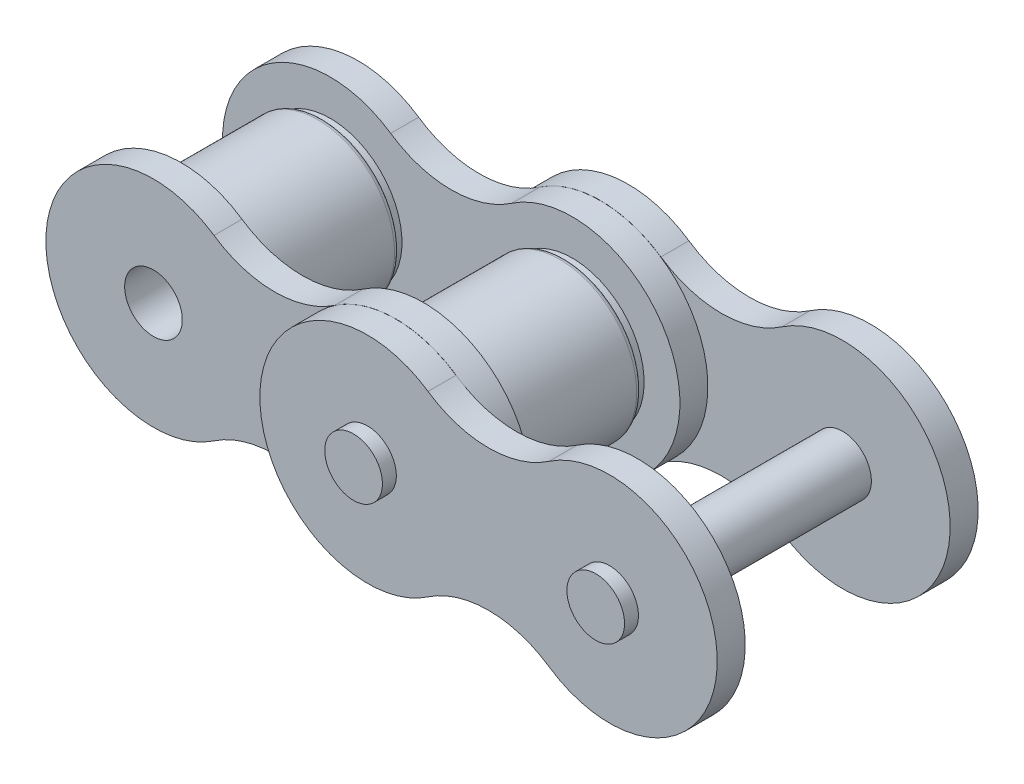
from build123d import *

# Parameters (mm, degrees)
BOSS_EXTRU_1_DEPTH = 2.202
BOSS_EXTRU_2_START = -2.202
BOSS_EXTRU_2_DEPTH = 2.202
ESQUISSE5_W        = 2.26875
ESQUISSE5_H        = 23.4
BOSS_EXTRU_3_DEPTH = 2.202
BOSS_EXTRU_4_START = -2.202
BOSS_EXTRU_4_DEPTH = 2.202
ESQUISSE8_W        = 2.26875
ESQUISSE8_H        = 22.71


with BuildPart() as part:
    # Esquisse1 → R_volution1 (revolve)
    with BuildSketch(Plane(origin=(0, 0, 0), x_dir=(1, 0, 0), z_dir=(0, 1, 0)), mode=Mode.PRIVATE) as r_volution1_sk:
        with BuildLine():
            Line((0, 5.85), (5.65, 5.85))
            Line((5.65, 5.85), (5.65, 5.265))
            ThreePointArc((5.65, 5.265), (5.932842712, 5.147842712), (6.05, 4.865))
            Line((6.05, 4.865), (6.05, -4.865))
            ThreePointArc((6.05, -4.865), (5.932842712, -5.147842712), (5.65, -5.265))
            Line((5.65, -5.265), (5.65, -5.85))
            Line((5.65, -5.85), (0, -5.85))
            Line((0, -5.85), (0, 5.85))
        make_face()
    revolve(r_volution1_sk.sketch.rotate(Axis((0, 0, 5.85), (0, 0, -1)), 180), axis=Axis((0, 0, 5.85), (0, 0, -1)))

    # Esquisse2 → Boss.-Extru.1 (add)
    with BuildSketch(Plane.XY.offset(5.85)):
        with BuildLine():
            ThreePointArc((4.7625, 7.000015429), (-8.4665, 0), (4.7625, -7.000015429))
            ThreePointArc((4.7625, -7.000015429), (9.525, -5.533530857), (14.2875, -7.000015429))
            ThreePointArc((14.2875, -7.000015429), (27.5165, 0), (14.2875, 7.000015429))
            ThreePointArc((14.2875, 7.000015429), (9.525, 5.533530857), (4.7625, 7.000015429))
        make_face()
    extrude(amount=BOSS_EXTRU_1_DEPTH)

    # Esquisse3 → Boss.-Extru.2 (add)
    with BuildSketch(Plane.XY.offset(-5.85).offset(BOSS_EXTRU_2_START)):
        with BuildLine():
            ThreePointArc((4.7625, 7.000015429), (-8.4665, 0), (4.7625, -7.000015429))
            ThreePointArc((4.7625, -7.000015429), (9.525, -5.533530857), (14.2875, -7.000015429))
            ThreePointArc((14.2875, -7.000015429), (27.5165, 0), (14.2875, 7.000015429))
            ThreePointArc((14.2875, 7.000015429), (9.525, 5.533530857), (4.7625, 7.000015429))
        make_face()
    extrude(amount=BOSS_EXTRU_2_DEPTH)

    # Esquisse4 → R_volution2 (revolve)
    with BuildSketch(Plane(origin=(0, 0, 0), x_dir=(1, 0, 0), z_dir=(0, 1, 0)), mode=Mode.PRIVATE) as r_volution2_sk:
        with BuildLine():
            Line((19.05, 11.355), (21.31875, 11.355))
            Line((21.31875, 11.355), (21.31875, 5.85))
            Line((21.31875, 5.85), (24.7, 5.85))
            Line((24.7, 5.85), (24.7, 5.265))
            ThreePointArc((24.7, 5.265), (24.982842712, 5.147842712), (25.1, 4.865))
            Line((25.1, 4.865), (25.1, -4.865))
            ThreePointArc((25.1, -4.865), (24.982842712, -5.147842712), (24.7, -5.265))
            Line((24.7, -5.265), (24.7, -5.85))
            Line((24.7, -5.85), (21.31875, -5.85))
            Line((21.31875, -5.85), (21.31875, -11.355))
            Line((21.31875, -11.355), (19.05, -11.355))
            Line((19.05, -11.355), (19.05, 11.355))
        make_face()
    revolve(r_volution2_sk.sketch.rotate(Axis((19.05, 0, 11.355), (0, 0, -1)), 180), axis=Axis((19.05, 0, 11.355), (0, 0, -1)))

    # Esquisse5 → Enl_vement de mati_re-R_volution1 (revolve, cut)
    with BuildSketch(Plane(origin=(0, 0, 0), x_dir=(1, 0, 0), z_dir=(0, 1, 0)), mode=Mode.PRIVATE) as enl_vement_de_mati_re_r_volution1_sk:
        with Locations((1.134375, 0)):
            Rectangle(ESQUISSE5_W, ESQUISSE5_H)
    revolve(enl_vement_de_mati_re_r_volution1_sk.sketch.rotate(Axis((0, 0, 11.7), (0, 0, -1)), 180), axis=Axis((0, 0, 11.7), (0, 0, -1)), mode=Mode.SUBTRACT)

    # Esquisse6 → Boss.-Extru.3 (add)
    with BuildSketch(Plane.XY.offset(8.062)):
        with BuildLine():
            ThreePointArc((23.8125, 7.000015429), (10.5835, 0), (23.8125, -7.000015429))
            ThreePointArc((23.8125, -7.000015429), (28.575, -5.533530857), (33.3375, -7.000015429))
            ThreePointArc((33.3375, -7.000015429), (46.5665, 0), (33.3375, 7.000015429))
            ThreePointArc((33.3375, 7.000015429), (28.575, 5.533530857), (23.8125, 7.000015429))
        make_face()
    extrude(amount=BOSS_EXTRU_3_DEPTH)

    # Esquisse7 → Boss.-Extru.4 (add)
    with BuildSketch(Plane.XY.offset(-8.062).offset(BOSS_EXTRU_4_START)):
        with BuildLine():
            ThreePointArc((23.8125, 7.000015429), (10.5835, 0), (23.8125, -7.000015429))
            ThreePointArc((23.8125, -7.000015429), (28.575, -5.533530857), (33.3375, -7.000015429))
            ThreePointArc((33.3375, -7.000015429), (46.5665, 0), (33.3375, 7.000015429))
            ThreePointArc((33.3375, 7.000015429), (28.575, 5.533530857), (23.8125, 7.000015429))
        make_face()
    extrude(amount=BOSS_EXTRU_4_DEPTH)

    # Esquisse8 → R_volution3 (revolve)
    with BuildSketch(Plane(origin=(0, 0, 0), x_dir=(1, 0, 0), z_dir=(0, 1, 0)), mode=Mode.PRIVATE) as r_volution3_sk:
        with Locations((39.234375, 0)):
            Rectangle(ESQUISSE8_W, ESQUISSE8_H)
    revolve(r_volution3_sk.sketch.rotate(Axis((38.1, 0, 11.355), (0, 0, -1)), 180), axis=Axis((38.1, 0, 11.355), (0, 0, -1)))


solid = part.part
